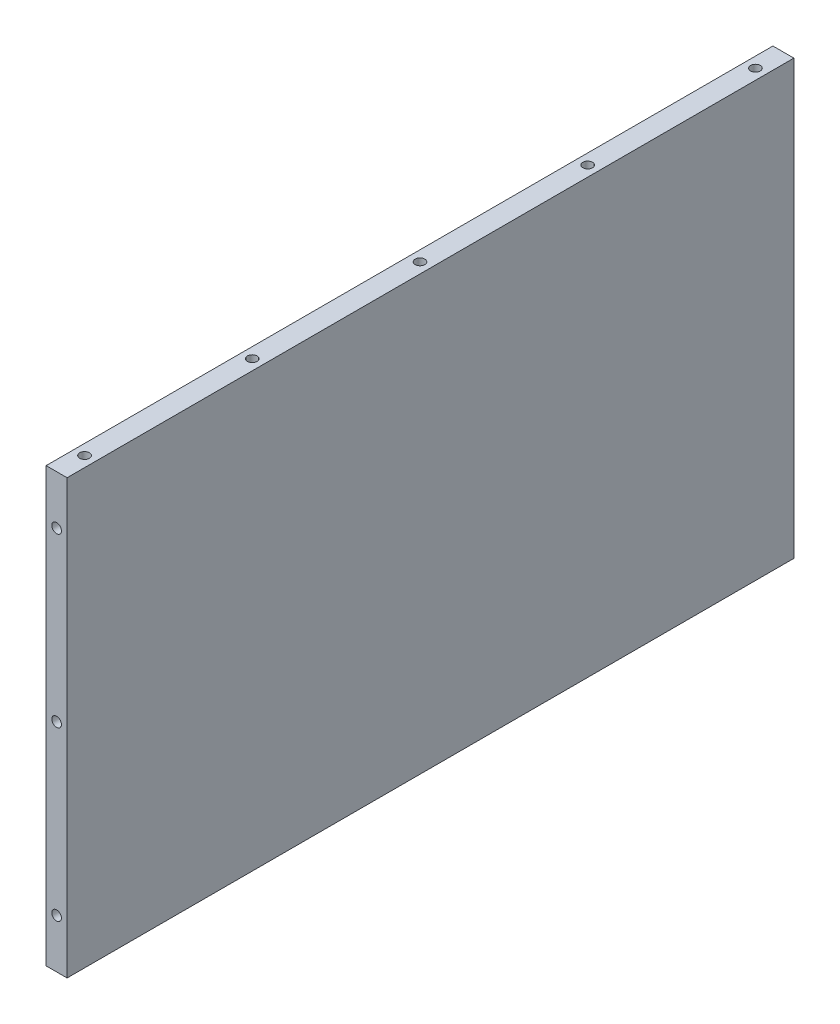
from build123d import *

# Parameters (mm, degrees)
SKETCH1_W           = 330.2
SKETCH1_H           = 196.85
BOSS_EXTRUDE1_DEPTH = 9.525
SKETCH2_R           = 2.1971
CUT_EXTRUDE1_DEPTH  = 15.24
CUT_EXTRUDE2_START  = -15.24
SKETCH3_R           = 2.1971
CUT_EXTRUDE2_DEPTH  = 15.24
SKETCH4_R           = 2.1971
CUT_EXTRUDE3_DEPTH  = 15.24
CUT_EXTRUDE4_START  = -15.24
SKETCH5_R           = 2.1971
CUT_EXTRUDE4_DEPTH  = 15.24


with BuildPart() as part:
    # Sketch1 → Boss-Extrude1 (new body)
    with BuildSketch(Plane(origin=(0, 0, 0), x_dir=(0, 0, -1), z_dir=(1, 0, 0))):
        Rectangle(SKETCH1_W, SKETCH1_H)
    extrude(amount=BOSS_EXTRUDE1_DEPTH)

    # Sketch2 → Cut-Extrude1 (cut)
    with BuildSketch(Plane(origin=(0, 98.425, 0), x_dir=(1, 0, 0), z_dir=(0, 1, 0))):
        with Locations(Location((4.7625, 0, 0), (0, 0, 270))):
            Circle(SKETCH2_R)
        with Locations(Location((4.7625, 76.2, 0), (0, 0, 270))):
            Circle(SKETCH2_R)
        with Locations(Location((4.7625, 152.4, 0), (0, 0, 270))):
            Circle(SKETCH2_R)
        with Locations(Location((4.7625, -76.2, 0), (0, 0, 270))):
            Circle(SKETCH2_R)
        with Locations(Location((4.7625, -152.4, 0), (0, 0, 270))):
            Circle(SKETCH2_R)
    extrude(amount=-CUT_EXTRUDE1_DEPTH, mode=Mode.SUBTRACT)

    # Sketch3 → Cut-Extrude2 (cut)
    with BuildSketch(Plane(origin=(0, -98.425, 0), x_dir=(-1, 0, 0), z_dir=(0, -1, 0)).offset(CUT_EXTRUDE2_START)):
        with Locations(Location((-4.7625, 0, 0), (0, 0, 270))):
            Circle(SKETCH3_R)
        with Locations(Location((-4.7625, 76.2, 0), (0, 0, 270))):
            Circle(SKETCH3_R)
        with Locations(Location((-4.7625, 152.4, 0), (0, 0, 270))):
            Circle(SKETCH3_R)
        with Locations(Location((-4.7625, -76.2, 0), (0, 0, 270))):
            Circle(SKETCH3_R)
        with Locations(Location((-4.7625, -152.4, 0), (0, 0, 270))):
            Circle(SKETCH3_R)
    extrude(amount=CUT_EXTRUDE2_DEPTH, mode=Mode.SUBTRACT)

    # Sketch4 → Cut-Extrude3 (cut)
    with BuildSketch(Plane(origin=(0, 0, -165.1), x_dir=(-1, 0, 0), z_dir=(0, 0, -1))):
        with Locations(Location((-4.7625, 0, 0), (0, 0, 90))):
            Circle(SKETCH4_R)
        with Locations(Location((-4.7625, 76.2, 0), (0, 0, 90))):
            Circle(SKETCH4_R)
        with Locations(Location((-4.7625, -76.2, 0), (0, 0, 90))):
            Circle(SKETCH4_R)
    extrude(amount=-CUT_EXTRUDE3_DEPTH, mode=Mode.SUBTRACT)

    # Sketch5 → Cut-Extrude4 (cut)
    with BuildSketch(Plane.XY.offset(165.1).offset(CUT_EXTRUDE4_START)):
        with Locations(Location((4.7625, 0, 0), (0, 0, 90))):
            Circle(SKETCH5_R)
        with Locations(Location((4.7625, 76.2, 0), (0, 0, 90))):
            Circle(SKETCH5_R)
        with Locations(Location((4.7625, -76.2, 0), (0, 0, 90))):
            Circle(SKETCH5_R)
    extrude(amount=CUT_EXTRUDE4_DEPTH, mode=Mode.SUBTRACT)


solid = part.part
